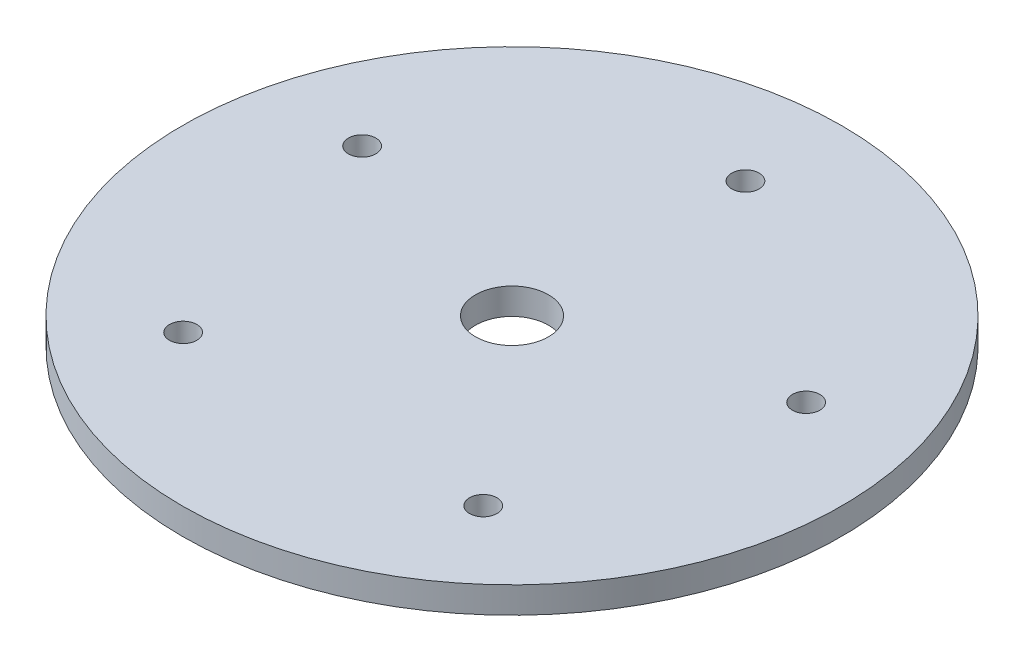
ISO-10303-21;
HEADER;
FILE_DESCRIPTION(('STEP AP214'),'2;1');
FILE_NAME('part.step','',(''),(''),'','','');
FILE_SCHEMA(('AUTOMOTIVE_DESIGN { 1 0 10303 214 1 1 1 1 }'));
ENDSEC;
DATA;
#1=APPLICATION_CONTEXT('core data for automotive mechanical design processes');
#2=APPLICATION_PROTOCOL_DEFINITION('international standard','automotive_design',2000,#1);
#3=PRODUCT_CONTEXT('',#1,'mechanical');
#4=PRODUCT('Part','Part','',(#3));
#5=PRODUCT_RELATED_PRODUCT_CATEGORY('part','',(#4));
#6=PRODUCT_DEFINITION_FORMATION('','',#4);
#7=PRODUCT_DEFINITION_CONTEXT('part definition',#1,'design');
#8=PRODUCT_DEFINITION('design','',#6,#7);
#9=PRODUCT_DEFINITION_SHAPE('','',#8);
#10=(LENGTH_UNIT() NAMED_UNIT(*) SI_UNIT(.MILLI.,.METRE.));
#11=(NAMED_UNIT(*) PLANE_ANGLE_UNIT() SI_UNIT($,.RADIAN.));
#12=(NAMED_UNIT(*) SI_UNIT($,.STERADIAN.) SOLID_ANGLE_UNIT());
#13=UNCERTAINTY_MEASURE_WITH_UNIT(LENGTH_MEASURE(1.E-05),#10,'distance_accuracy_value','');
#14=(GEOMETRIC_REPRESENTATION_CONTEXT(3) GLOBAL_UNCERTAINTY_ASSIGNED_CONTEXT((#13)) GLOBAL_UNIT_ASSIGNED_CONTEXT((#10,
#11,#12)) REPRESENTATION_CONTEXT('',''));
#15=CARTESIAN_POINT('',(0.,0.,0.));
#16=DIRECTION('',(0.,0.,1.));
#17=DIRECTION('',(1.,0.,0.));
#18=AXIS2_PLACEMENT_3D('',#15,#16,#17);
#19=CARTESIAN_POINT('',(0.,3.048,0.));
#20=DIRECTION('',(0.,1.,0.));
#21=DIRECTION('',(0.,0.,1.));
#22=AXIS2_PLACEMENT_3D('',#19,#20,#21);
#23=PLANE('',#22);
#24=CARTESIAN_POINT('',(0.,3.048,0.));
#25=DIRECTION('',(0.,1.,0.));
#26=DIRECTION('',(0.,0.,1.));
#27=AXIS2_PLACEMENT_3D('',#24,#25,#26);
#28=CIRCLE('',#27,4.2164);
#29=CARTESIAN_POINT('',(0.,3.048,4.2164));
#30=VERTEX_POINT('',#29);
#31=EDGE_CURVE('E71',#30,#30,#28,.T.);
#32=ORIENTED_EDGE('',*,*,#31,.F.);
#33=EDGE_LOOP('',(#32));
#34=FACE_BOUND('',#33,.T.);
#35=CARTESIAN_POINT('',(-17.3472306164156,3.048,20.6736244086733));
#36=DIRECTION('',(0.,1.,0.));
#37=DIRECTION('',(0.,0.,1.));
#38=AXIS2_PLACEMENT_3D('',#35,#36,#37);
#39=CIRCLE('',#38,1.5875);
#40=CARTESIAN_POINT('',(-17.3472306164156,3.048,19.0861244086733));
#41=VERTEX_POINT('',#40);
#42=EDGE_CURVE('E59',#41,#41,#39,.T.);
#43=ORIENTED_EDGE('',*,*,#42,.F.);
#44=EDGE_LOOP('',(#43));
#45=FACE_BOUND('',#44,.T.);
#46=CARTESIAN_POINT('',(25.6666377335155,3.048,-8.33959613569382));
#47=DIRECTION('',(0.,1.,0.));
#48=DIRECTION('',(0.,0.,1.));
#49=AXIS2_PLACEMENT_3D('',#46,#47,#48);
#50=CIRCLE('',#49,1.5875);
#51=CARTESIAN_POINT('',(25.6666377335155,3.048,-9.92709613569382));
#52=VERTEX_POINT('',#51);
#53=EDGE_CURVE('E47',#52,#52,#50,.T.);
#54=ORIENTED_EDGE('',*,*,#53,.F.);
#55=EDGE_LOOP('',(#54));
#56=FACE_BOUND('',#55,.T.);
#57=CARTESIAN_POINT('',(0.,3.048,0.));
#58=DIRECTION('',(0.,1.,0.));
#59=DIRECTION('',(0.,0.,1.));
#60=AXIS2_PLACEMENT_3D('',#57,#58,#59);
#61=CIRCLE('',#60,38.1);
#62=CARTESIAN_POINT('',(0.,3.048,-38.1));
#63=VERTEX_POINT('',#62);
#64=EDGE_CURVE('E10',#63,#63,#61,.T.);
#65=ORIENTED_EDGE('',*,*,#64,.T.);
#66=EDGE_LOOP('',(#65));
#67=FACE_BOUND('',#66,.T.);
#68=CARTESIAN_POINT('',(0.,3.048,-26.9875));
#69=DIRECTION('',(0.,1.,0.));
#70=DIRECTION('',(0.,0.,1.));
#71=AXIS2_PLACEMENT_3D('',#68,#69,#70);
#72=CIRCLE('',#71,1.5875);
#73=CARTESIAN_POINT('',(0.,3.048,-28.575));
#74=VERTEX_POINT('',#73);
#75=EDGE_CURVE('E42',#74,#74,#72,.T.);
#76=ORIENTED_EDGE('',*,*,#75,.F.);
#77=EDGE_LOOP('',(#76));
#78=FACE_BOUND('',#77,.T.);
#79=CARTESIAN_POINT('',(17.3472306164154,3.048,20.6736244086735));
#80=DIRECTION('',(0.,1.,0.));
#81=DIRECTION('',(0.,0.,1.));
#82=AXIS2_PLACEMENT_3D('',#79,#80,#81);
#83=CIRCLE('',#82,1.5875);
#84=CARTESIAN_POINT('',(17.3472306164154,3.048,19.0861244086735));
#85=VERTEX_POINT('',#84);
#86=EDGE_CURVE('E53',#85,#85,#83,.T.);
#87=ORIENTED_EDGE('',*,*,#86,.F.);
#88=EDGE_LOOP('',(#87));
#89=FACE_BOUND('',#88,.T.);
#90=CARTESIAN_POINT('',(-25.6666377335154,3.048,-8.33959613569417));
#91=DIRECTION('',(0.,1.,0.));
#92=DIRECTION('',(0.,0.,1.));
#93=AXIS2_PLACEMENT_3D('',#90,#91,#92);
#94=CIRCLE('',#93,1.5875);
#95=CARTESIAN_POINT('',(-25.6666377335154,3.048,-9.92709613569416));
#96=VERTEX_POINT('',#95);
#97=EDGE_CURVE('E65',#96,#96,#94,.T.);
#98=ORIENTED_EDGE('',*,*,#97,.F.);
#99=EDGE_LOOP('',(#98));
#100=FACE_BOUND('',#99,.T.);
#101=ADVANCED_FACE('F31',(#34,#45,#56,#67,#78,#89,#100),#23,.T.);
#102=CARTESIAN_POINT('',(0.,0.,0.));
#103=DIRECTION('',(0.,1.,0.));
#104=DIRECTION('',(0.,0.,1.));
#105=AXIS2_PLACEMENT_3D('',#102,#103,#104);
#106=PLANE('',#105);
#107=CARTESIAN_POINT('',(0.,0.,0.));
#108=DIRECTION('',(0.,1.,0.));
#109=DIRECTION('',(0.,0.,1.));
#110=AXIS2_PLACEMENT_3D('',#107,#108,#109);
#111=CIRCLE('',#110,4.2164);
#112=CARTESIAN_POINT('',(0.,0.,4.2164));
#113=VERTEX_POINT('',#112);
#114=EDGE_CURVE('E76',#113,#113,#111,.T.);
#115=ORIENTED_EDGE('',*,*,#114,.T.);
#116=EDGE_LOOP('',(#115));
#117=FACE_BOUND('',#116,.T.);
#118=CARTESIAN_POINT('',(0.,0.,0.));
#119=DIRECTION('',(0.,1.,0.));
#120=DIRECTION('',(0.,0.,1.));
#121=AXIS2_PLACEMENT_3D('',#118,#119,#120);
#122=CIRCLE('',#121,38.1);
#123=CARTESIAN_POINT('',(0.,0.,-38.1));
#124=VERTEX_POINT('',#123);
#125=EDGE_CURVE('E35',#124,#124,#122,.T.);
#126=ORIENTED_EDGE('',*,*,#125,.F.);
#127=EDGE_LOOP('',(#126));
#128=FACE_BOUND('',#127,.T.);
#129=CARTESIAN_POINT('',(0.,0.,-26.9875));
#130=DIRECTION('',(0.,1.,0.));
#131=DIRECTION('',(0.,0.,1.));
#132=AXIS2_PLACEMENT_3D('',#129,#130,#131);
#133=CIRCLE('',#132,1.5875);
#134=CARTESIAN_POINT('',(0.,0.,-28.575));
#135=VERTEX_POINT('',#134);
#136=EDGE_CURVE('E44',#135,#135,#133,.T.);
#137=ORIENTED_EDGE('',*,*,#136,.T.);
#138=EDGE_LOOP('',(#137));
#139=FACE_BOUND('',#138,.T.);
#140=CARTESIAN_POINT('',(25.6666377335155,0.,-8.33959613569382));
#141=DIRECTION('',(0.,1.,0.));
#142=DIRECTION('',(0.,0.,1.));
#143=AXIS2_PLACEMENT_3D('',#140,#141,#142);
#144=CIRCLE('',#143,1.5875);
#145=CARTESIAN_POINT('',(25.6666377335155,0.,-9.92709613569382));
#146=VERTEX_POINT('',#145);
#147=EDGE_CURVE('E50',#146,#146,#144,.T.);
#148=ORIENTED_EDGE('',*,*,#147,.T.);
#149=EDGE_LOOP('',(#148));
#150=FACE_BOUND('',#149,.T.);
#151=CARTESIAN_POINT('',(17.3472306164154,0.,20.6736244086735));
#152=DIRECTION('',(0.,1.,0.));
#153=DIRECTION('',(0.,0.,1.));
#154=AXIS2_PLACEMENT_3D('',#151,#152,#153);
#155=CIRCLE('',#154,1.5875);
#156=CARTESIAN_POINT('',(17.3472306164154,0.,19.0861244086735));
#157=VERTEX_POINT('',#156);
#158=EDGE_CURVE('E56',#157,#157,#155,.T.);
#159=ORIENTED_EDGE('',*,*,#158,.T.);
#160=EDGE_LOOP('',(#159));
#161=FACE_BOUND('',#160,.T.);
#162=CARTESIAN_POINT('',(-17.3472306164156,0.,20.6736244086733));
#163=DIRECTION('',(0.,1.,0.));
#164=DIRECTION('',(0.,0.,1.));
#165=AXIS2_PLACEMENT_3D('',#162,#163,#164);
#166=CIRCLE('',#165,1.5875);
#167=CARTESIAN_POINT('',(-17.3472306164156,0.,19.0861244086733));
#168=VERTEX_POINT('',#167);
#169=EDGE_CURVE('E62',#168,#168,#166,.T.);
#170=ORIENTED_EDGE('',*,*,#169,.T.);
#171=EDGE_LOOP('',(#170));
#172=FACE_BOUND('',#171,.T.);
#173=CARTESIAN_POINT('',(-25.6666377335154,0.,-8.33959613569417));
#174=DIRECTION('',(0.,1.,0.));
#175=DIRECTION('',(0.,0.,1.));
#176=AXIS2_PLACEMENT_3D('',#173,#174,#175);
#177=CIRCLE('',#176,1.5875);
#178=CARTESIAN_POINT('',(-25.6666377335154,0.,-9.92709613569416));
#179=VERTEX_POINT('',#178);
#180=EDGE_CURVE('E68',#179,#179,#177,.T.);
#181=ORIENTED_EDGE('',*,*,#180,.T.);
#182=EDGE_LOOP('',(#181));
#183=FACE_BOUND('',#182,.T.);
#184=ADVANCED_FACE('F80',(#117,#128,#139,#150,#161,#172,#183),#106,.F.);
#185=CARTESIAN_POINT('',(0.,3.048,0.));
#186=DIRECTION('',(0.,-1.,0.));
#187=DIRECTION('',(0.,0.,-1.));
#188=AXIS2_PLACEMENT_3D('',#185,#186,#187);
#189=CYLINDRICAL_SURFACE('',#188,38.1);
#190=CARTESIAN_POINT('',(0.,3.048,-38.1));
#191=CARTESIAN_POINT('',(0.,3.01625,-38.1));
#192=CARTESIAN_POINT('',(0.,2.9845,-38.1));
#193=CARTESIAN_POINT('',(0.,2.921,-38.1));
#194=CARTESIAN_POINT('',(0.,2.88925,-38.1));
#195=CARTESIAN_POINT('',(0.,2.82575,-38.1));
#196=CARTESIAN_POINT('',(0.,2.794,-38.1));
#197=CARTESIAN_POINT('',(0.,2.7305,-38.1));
#198=CARTESIAN_POINT('',(0.,2.69875,-38.1));
#199=CARTESIAN_POINT('',(0.,2.63525,-38.1));
#200=CARTESIAN_POINT('',(0.,2.6035,-38.1));
#201=CARTESIAN_POINT('',(0.,2.54,-38.1));
#202=CARTESIAN_POINT('',(0.,2.50825,-38.1));
#203=CARTESIAN_POINT('',(0.,2.44475,-38.1));
#204=CARTESIAN_POINT('',(0.,2.413,-38.1));
#205=CARTESIAN_POINT('',(0.,2.3495,-38.1));
#206=CARTESIAN_POINT('',(0.,2.31775,-38.1));
#207=CARTESIAN_POINT('',(0.,2.25425,-38.1));
#208=CARTESIAN_POINT('',(0.,2.2225,-38.1));
#209=CARTESIAN_POINT('',(0.,2.159,-38.1));
#210=CARTESIAN_POINT('',(0.,2.12725,-38.1));
#211=CARTESIAN_POINT('',(0.,2.06375,-38.1));
#212=CARTESIAN_POINT('',(0.,2.032,-38.1));
#213=CARTESIAN_POINT('',(0.,1.9685,-38.1));
#214=CARTESIAN_POINT('',(0.,1.93675,-38.1));
#215=CARTESIAN_POINT('',(0.,1.87325,-38.1));
#216=CARTESIAN_POINT('',(0.,1.8415,-38.1));
#217=CARTESIAN_POINT('',(0.,1.778,-38.1));
#218=CARTESIAN_POINT('',(0.,1.74625,-38.1));
#219=CARTESIAN_POINT('',(0.,1.68275,-38.1));
#220=CARTESIAN_POINT('',(0.,1.651,-38.1));
#221=CARTESIAN_POINT('',(0.,1.5875,-38.1));
#222=CARTESIAN_POINT('',(0.,1.55575,-38.1));
#223=CARTESIAN_POINT('',(0.,1.49225,-38.1));
#224=CARTESIAN_POINT('',(0.,1.4605,-38.1));
#225=CARTESIAN_POINT('',(0.,1.397,-38.1));
#226=CARTESIAN_POINT('',(0.,1.36525,-38.1));
#227=CARTESIAN_POINT('',(0.,1.30175,-38.1));
#228=CARTESIAN_POINT('',(0.,1.27,-38.1));
#229=CARTESIAN_POINT('',(0.,1.2065,-38.1));
#230=CARTESIAN_POINT('',(0.,1.17475,-38.1));
#231=CARTESIAN_POINT('',(0.,1.11125,-38.1));
#232=CARTESIAN_POINT('',(0.,1.0795,-38.1));
#233=CARTESIAN_POINT('',(0.,1.016,-38.1));
#234=CARTESIAN_POINT('',(0.,0.98425,-38.1));
#235=CARTESIAN_POINT('',(0.,0.92075,-38.1));
#236=CARTESIAN_POINT('',(0.,0.889,-38.1));
#237=CARTESIAN_POINT('',(0.,0.8255,-38.1));
#238=CARTESIAN_POINT('',(0.,0.79375,-38.1));
#239=CARTESIAN_POINT('',(0.,0.73025,-38.1));
#240=CARTESIAN_POINT('',(0.,0.6985,-38.1));
#241=CARTESIAN_POINT('',(0.,0.635,-38.1));
#242=CARTESIAN_POINT('',(0.,0.60325,-38.1));
#243=CARTESIAN_POINT('',(0.,0.53975,-38.1));
#244=CARTESIAN_POINT('',(0.,0.508,-38.1));
#245=CARTESIAN_POINT('',(0.,0.4445,-38.1));
#246=CARTESIAN_POINT('',(0.,0.41275,-38.1));
#247=CARTESIAN_POINT('',(0.,0.34925,-38.1));
#248=CARTESIAN_POINT('',(0.,0.3175,-38.1));
#249=CARTESIAN_POINT('',(0.,0.254,-38.1));
#250=CARTESIAN_POINT('',(0.,0.22225,-38.1));
#251=CARTESIAN_POINT('',(0.,0.15875,-38.1));
#252=CARTESIAN_POINT('',(0.,0.127,-38.1));
#253=CARTESIAN_POINT('',(0.,0.0634999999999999,-38.1));
#254=CARTESIAN_POINT('',(0.,0.03175,-38.1));
#255=CARTESIAN_POINT('',(0.,0.,-38.1));
#256=B_SPLINE_CURVE_WITH_KNOTS('',3,(#190,#191,#192,#193,#194,#195,#196,#197,#198,#199,#200,
#201,#202,#203,#204,#205,#206,#207,#208,#209,#210,#211,#212,#213,#214,#215,#216,#217,#218,#219,
#220,#221,#222,#223,#224,#225,#226,#227,#228,#229,#230,#231,#232,#233,#234,#235,#236,#237,#238,
#239,#240,#241,#242,#243,#244,#245,#246,#247,#248,#249,#250,#251,#252,#253,#254,#255),
.UNSPECIFIED.,.F.,.F.,(4,2,2,2,2,2,2,2,2,2,2,2,2,2,2,2,2,2,2,2,2,2,2,2,2,2,2,2,2,2,2,2,4),(0.,
0.0952499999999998,0.1905,0.28575,0.381,0.47625,0.5715,0.66675,0.762,0.85725,0.9525,1.04775,
1.143,1.23825,1.3335,1.42875,1.524,1.61925,1.7145,1.80975,1.905,2.00025,2.0955,2.19075,2.286,
2.38125,2.4765,2.57175,2.667,2.76225,2.8575,2.95275,3.048),.UNSPECIFIED.);
#257=EDGE_CURVE('BSEAM33',#63,#124,#256,.T.);
#258=ORIENTED_EDGE('',*,*,#64,.F.);
#259=ORIENTED_EDGE('',*,*,#125,.T.);
#260=ORIENTED_EDGE('',*,*,#257,.T.);
#261=ORIENTED_EDGE('',*,*,#257,.F.);
#262=EDGE_LOOP('',(#258,#260,#259,#261));
#263=FACE_BOUND('',#262,.T.);
#264=ADVANCED_FACE('F33',(#263),#189,.T.);
#265=CARTESIAN_POINT('',(0.,3.048,-26.9875));
#266=DIRECTION('',(0.,-1.,0.));
#267=DIRECTION('',(0.,0.,-1.));
#268=AXIS2_PLACEMENT_3D('',#265,#266,#267);
#269=CYLINDRICAL_SURFACE('',#268,1.5875);
#270=CARTESIAN_POINT('',(0.,3.048,-28.575));
#271=CARTESIAN_POINT('',(0.,3.01625,-28.575));
#272=CARTESIAN_POINT('',(0.,2.9845,-28.575));
#273=CARTESIAN_POINT('',(0.,2.921,-28.575));
#274=CARTESIAN_POINT('',(0.,2.88925,-28.575));
#275=CARTESIAN_POINT('',(0.,2.82575,-28.575));
#276=CARTESIAN_POINT('',(0.,2.794,-28.575));
#277=CARTESIAN_POINT('',(0.,2.7305,-28.575));
#278=CARTESIAN_POINT('',(0.,2.69875,-28.575));
#279=CARTESIAN_POINT('',(0.,2.63525,-28.575));
#280=CARTESIAN_POINT('',(0.,2.6035,-28.575));
#281=CARTESIAN_POINT('',(0.,2.54,-28.575));
#282=CARTESIAN_POINT('',(0.,2.50825,-28.575));
#283=CARTESIAN_POINT('',(0.,2.44475,-28.575));
#284=CARTESIAN_POINT('',(0.,2.413,-28.575));
#285=CARTESIAN_POINT('',(0.,2.3495,-28.575));
#286=CARTESIAN_POINT('',(0.,2.31775,-28.575));
#287=CARTESIAN_POINT('',(0.,2.25425,-28.575));
#288=CARTESIAN_POINT('',(0.,2.2225,-28.575));
#289=CARTESIAN_POINT('',(0.,2.159,-28.575));
#290=CARTESIAN_POINT('',(0.,2.12725,-28.575));
#291=CARTESIAN_POINT('',(0.,2.06375,-28.575));
#292=CARTESIAN_POINT('',(0.,2.032,-28.575));
#293=CARTESIAN_POINT('',(0.,1.9685,-28.575));
#294=CARTESIAN_POINT('',(0.,1.93675,-28.575));
#295=CARTESIAN_POINT('',(0.,1.87325,-28.575));
#296=CARTESIAN_POINT('',(0.,1.8415,-28.575));
#297=CARTESIAN_POINT('',(0.,1.778,-28.575));
#298=CARTESIAN_POINT('',(0.,1.74625,-28.575));
#299=CARTESIAN_POINT('',(0.,1.68275,-28.575));
#300=CARTESIAN_POINT('',(0.,1.651,-28.575));
#301=CARTESIAN_POINT('',(0.,1.5875,-28.575));
#302=CARTESIAN_POINT('',(0.,1.55575,-28.575));
#303=CARTESIAN_POINT('',(0.,1.49225,-28.575));
#304=CARTESIAN_POINT('',(0.,1.4605,-28.575));
#305=CARTESIAN_POINT('',(0.,1.397,-28.575));
#306=CARTESIAN_POINT('',(0.,1.36525,-28.575));
#307=CARTESIAN_POINT('',(0.,1.30175,-28.575));
#308=CARTESIAN_POINT('',(0.,1.27,-28.575));
#309=CARTESIAN_POINT('',(0.,1.2065,-28.575));
#310=CARTESIAN_POINT('',(0.,1.17475,-28.575));
#311=CARTESIAN_POINT('',(0.,1.11125,-28.575));
#312=CARTESIAN_POINT('',(0.,1.0795,-28.575));
#313=CARTESIAN_POINT('',(0.,1.016,-28.575));
#314=CARTESIAN_POINT('',(0.,0.98425,-28.575));
#315=CARTESIAN_POINT('',(0.,0.92075,-28.575));
#316=CARTESIAN_POINT('',(0.,0.889,-28.575));
#317=CARTESIAN_POINT('',(0.,0.8255,-28.575));
#318=CARTESIAN_POINT('',(0.,0.79375,-28.575));
#319=CARTESIAN_POINT('',(0.,0.73025,-28.575));
#320=CARTESIAN_POINT('',(0.,0.6985,-28.575));
#321=CARTESIAN_POINT('',(0.,0.635,-28.575));
#322=CARTESIAN_POINT('',(0.,0.60325,-28.575));
#323=CARTESIAN_POINT('',(0.,0.53975,-28.575));
#324=CARTESIAN_POINT('',(0.,0.508,-28.575));
#325=CARTESIAN_POINT('',(0.,0.4445,-28.575));
#326=CARTESIAN_POINT('',(0.,0.41275,-28.575));
#327=CARTESIAN_POINT('',(0.,0.34925,-28.575));
#328=CARTESIAN_POINT('',(0.,0.3175,-28.575));
#329=CARTESIAN_POINT('',(0.,0.254,-28.575));
#330=CARTESIAN_POINT('',(0.,0.22225,-28.575));
#331=CARTESIAN_POINT('',(0.,0.15875,-28.575));
#332=CARTESIAN_POINT('',(0.,0.127,-28.575));
#333=CARTESIAN_POINT('',(0.,0.0634999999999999,-28.575));
#334=CARTESIAN_POINT('',(0.,0.03175,-28.575));
#335=CARTESIAN_POINT('',(0.,0.,-28.575));
#336=B_SPLINE_CURVE_WITH_KNOTS('',3,(#270,#271,#272,#273,#274,#275,#276,#277,#278,#279,#280,
#281,#282,#283,#284,#285,#286,#287,#288,#289,#290,#291,#292,#293,#294,#295,#296,#297,#298,#299,
#300,#301,#302,#303,#304,#305,#306,#307,#308,#309,#310,#311,#312,#313,#314,#315,#316,#317,#318,
#319,#320,#321,#322,#323,#324,#325,#326,#327,#328,#329,#330,#331,#332,#333,#334,#335),
.UNSPECIFIED.,.F.,.F.,(4,2,2,2,2,2,2,2,2,2,2,2,2,2,2,2,2,2,2,2,2,2,2,2,2,2,2,2,2,2,2,2,4),(0.,
0.0952499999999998,0.1905,0.28575,0.381,0.47625,0.5715,0.66675,0.762,0.85725,0.9525,1.04775,
1.143,1.23825,1.3335,1.42875,1.524,1.61925,1.7145,1.80975,1.905,2.00025,2.0955,2.19075,2.286,
2.38125,2.4765,2.57175,2.667,2.76225,2.8575,2.95275,3.048),.UNSPECIFIED.);
#337=EDGE_CURVE('BSEAM104',#74,#135,#336,.T.);
#338=ORIENTED_EDGE('',*,*,#75,.T.);
#339=ORIENTED_EDGE('',*,*,#136,.F.);
#340=ORIENTED_EDGE('',*,*,#337,.T.);
#341=ORIENTED_EDGE('',*,*,#337,.F.);
#342=EDGE_LOOP('',(#338,#340,#339,#341));
#343=FACE_BOUND('',#342,.T.);
#344=ADVANCED_FACE('F104',(#343),#269,.F.);
#345=CARTESIAN_POINT('',(25.6666377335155,3.048,-8.33959613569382));
#346=DIRECTION('',(0.,-1.,0.));
#347=DIRECTION('',(0.,0.,-1.));
#348=AXIS2_PLACEMENT_3D('',#345,#346,#347);
#349=CYLINDRICAL_SURFACE('',#348,1.5875);
#350=CARTESIAN_POINT('',(25.6666377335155,3.048,-9.92709613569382));
#351=CARTESIAN_POINT('',(25.6666377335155,3.01625,-9.92709613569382));
#352=CARTESIAN_POINT('',(25.6666377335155,2.9845,-9.92709613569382));
#353=CARTESIAN_POINT('',(25.6666377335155,2.921,-9.92709613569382));
#354=CARTESIAN_POINT('',(25.6666377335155,2.88925,-9.92709613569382));
#355=CARTESIAN_POINT('',(25.6666377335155,2.82575,-9.92709613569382));
#356=CARTESIAN_POINT('',(25.6666377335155,2.794,-9.92709613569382));
#357=CARTESIAN_POINT('',(25.6666377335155,2.7305,-9.92709613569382));
#358=CARTESIAN_POINT('',(25.6666377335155,2.69875,-9.92709613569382));
#359=CARTESIAN_POINT('',(25.6666377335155,2.63525,-9.92709613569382));
#360=CARTESIAN_POINT('',(25.6666377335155,2.6035,-9.92709613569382));
#361=CARTESIAN_POINT('',(25.6666377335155,2.54,-9.92709613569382));
#362=CARTESIAN_POINT('',(25.6666377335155,2.50825,-9.92709613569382));
#363=CARTESIAN_POINT('',(25.6666377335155,2.44475,-9.92709613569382));
#364=CARTESIAN_POINT('',(25.6666377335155,2.413,-9.92709613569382));
#365=CARTESIAN_POINT('',(25.6666377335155,2.3495,-9.92709613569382));
#366=CARTESIAN_POINT('',(25.6666377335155,2.31775,-9.92709613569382));
#367=CARTESIAN_POINT('',(25.6666377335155,2.25425,-9.92709613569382));
#368=CARTESIAN_POINT('',(25.6666377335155,2.2225,-9.92709613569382));
#369=CARTESIAN_POINT('',(25.6666377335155,2.159,-9.92709613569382));
#370=CARTESIAN_POINT('',(25.6666377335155,2.12725,-9.92709613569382));
#371=CARTESIAN_POINT('',(25.6666377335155,2.06375,-9.92709613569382));
#372=CARTESIAN_POINT('',(25.6666377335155,2.032,-9.92709613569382));
#373=CARTESIAN_POINT('',(25.6666377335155,1.9685,-9.92709613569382));
#374=CARTESIAN_POINT('',(25.6666377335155,1.93675,-9.92709613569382));
#375=CARTESIAN_POINT('',(25.6666377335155,1.87325,-9.92709613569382));
#376=CARTESIAN_POINT('',(25.6666377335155,1.8415,-9.92709613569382));
#377=CARTESIAN_POINT('',(25.6666377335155,1.778,-9.92709613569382));
#378=CARTESIAN_POINT('',(25.6666377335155,1.74625,-9.92709613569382));
#379=CARTESIAN_POINT('',(25.6666377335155,1.68275,-9.92709613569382));
#380=CARTESIAN_POINT('',(25.6666377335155,1.651,-9.92709613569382));
#381=CARTESIAN_POINT('',(25.6666377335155,1.5875,-9.92709613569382));
#382=CARTESIAN_POINT('',(25.6666377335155,1.55575,-9.92709613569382));
#383=CARTESIAN_POINT('',(25.6666377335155,1.49225,-9.92709613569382));
#384=CARTESIAN_POINT('',(25.6666377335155,1.4605,-9.92709613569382));
#385=CARTESIAN_POINT('',(25.6666377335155,1.397,-9.92709613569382));
#386=CARTESIAN_POINT('',(25.6666377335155,1.36525,-9.92709613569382));
#387=CARTESIAN_POINT('',(25.6666377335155,1.30175,-9.92709613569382));
#388=CARTESIAN_POINT('',(25.6666377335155,1.27,-9.92709613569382));
#389=CARTESIAN_POINT('',(25.6666377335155,1.2065,-9.92709613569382));
#390=CARTESIAN_POINT('',(25.6666377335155,1.17475,-9.92709613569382));
#391=CARTESIAN_POINT('',(25.6666377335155,1.11125,-9.92709613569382));
#392=CARTESIAN_POINT('',(25.6666377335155,1.0795,-9.92709613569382));
#393=CARTESIAN_POINT('',(25.6666377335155,1.016,-9.92709613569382));
#394=CARTESIAN_POINT('',(25.6666377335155,0.98425,-9.92709613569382));
#395=CARTESIAN_POINT('',(25.6666377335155,0.92075,-9.92709613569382));
#396=CARTESIAN_POINT('',(25.6666377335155,0.889,-9.92709613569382));
#397=CARTESIAN_POINT('',(25.6666377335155,0.8255,-9.92709613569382));
#398=CARTESIAN_POINT('',(25.6666377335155,0.79375,-9.92709613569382));
#399=CARTESIAN_POINT('',(25.6666377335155,0.73025,-9.92709613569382));
#400=CARTESIAN_POINT('',(25.6666377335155,0.6985,-9.92709613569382));
#401=CARTESIAN_POINT('',(25.6666377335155,0.635,-9.92709613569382));
#402=CARTESIAN_POINT('',(25.6666377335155,0.60325,-9.92709613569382));
#403=CARTESIAN_POINT('',(25.6666377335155,0.53975,-9.92709613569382));
#404=CARTESIAN_POINT('',(25.6666377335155,0.508,-9.92709613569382));
#405=CARTESIAN_POINT('',(25.6666377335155,0.4445,-9.92709613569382));
#406=CARTESIAN_POINT('',(25.6666377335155,0.41275,-9.92709613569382));
#407=CARTESIAN_POINT('',(25.6666377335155,0.34925,-9.92709613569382));
#408=CARTESIAN_POINT('',(25.6666377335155,0.3175,-9.92709613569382));
#409=CARTESIAN_POINT('',(25.6666377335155,0.254,-9.92709613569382));
#410=CARTESIAN_POINT('',(25.6666377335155,0.22225,-9.92709613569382));
#411=CARTESIAN_POINT('',(25.6666377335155,0.15875,-9.92709613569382));
#412=CARTESIAN_POINT('',(25.6666377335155,0.127,-9.92709613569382));
#413=CARTESIAN_POINT('',(25.6666377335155,0.0634999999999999,-9.92709613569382));
#414=CARTESIAN_POINT('',(25.6666377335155,0.03175,-9.92709613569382));
#415=CARTESIAN_POINT('',(25.6666377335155,0.,-9.92709613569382));
#416=B_SPLINE_CURVE_WITH_KNOTS('',3,(#350,#351,#352,#353,#354,#355,#356,#357,#358,#359,#360,
#361,#362,#363,#364,#365,#366,#367,#368,#369,#370,#371,#372,#373,#374,#375,#376,#377,#378,#379,
#380,#381,#382,#383,#384,#385,#386,#387,#388,#389,#390,#391,#392,#393,#394,#395,#396,#397,#398,
#399,#400,#401,#402,#403,#404,#405,#406,#407,#408,#409,#410,#411,#412,#413,#414,#415),
.UNSPECIFIED.,.F.,.F.,(4,2,2,2,2,2,2,2,2,2,2,2,2,2,2,2,2,2,2,2,2,2,2,2,2,2,2,2,2,2,2,2,4),(0.,
0.0952499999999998,0.1905,0.28575,0.381,0.47625,0.5715,0.66675,0.762,0.85725,0.9525,1.04775,
1.143,1.23825,1.3335,1.42875,1.524,1.61925,1.7145,1.80975,1.905,2.00025,2.0955,2.19075,2.286,
2.38125,2.4765,2.57175,2.667,2.76225,2.8575,2.95275,3.048),.UNSPECIFIED.);
#417=EDGE_CURVE('BSEAM107',#52,#146,#416,.T.);
#418=ORIENTED_EDGE('',*,*,#53,.T.);
#419=ORIENTED_EDGE('',*,*,#147,.F.);
#420=ORIENTED_EDGE('',*,*,#417,.T.);
#421=ORIENTED_EDGE('',*,*,#417,.F.);
#422=EDGE_LOOP('',(#418,#420,#419,#421));
#423=FACE_BOUND('',#422,.T.);
#424=ADVANCED_FACE('F107',(#423),#349,.F.);
#425=CARTESIAN_POINT('',(17.3472306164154,3.048,20.6736244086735));
#426=DIRECTION('',(0.,-1.,0.));
#427=DIRECTION('',(0.,0.,-1.));
#428=AXIS2_PLACEMENT_3D('',#425,#426,#427);
#429=CYLINDRICAL_SURFACE('',#428,1.5875);
#430=CARTESIAN_POINT('',(17.3472306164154,3.048,19.0861244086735));
#431=CARTESIAN_POINT('',(17.3472306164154,3.01625,19.0861244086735));
#432=CARTESIAN_POINT('',(17.3472306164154,2.9845,19.0861244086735));
#433=CARTESIAN_POINT('',(17.3472306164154,2.921,19.0861244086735));
#434=CARTESIAN_POINT('',(17.3472306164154,2.88925,19.0861244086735));
#435=CARTESIAN_POINT('',(17.3472306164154,2.82575,19.0861244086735));
#436=CARTESIAN_POINT('',(17.3472306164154,2.794,19.0861244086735));
#437=CARTESIAN_POINT('',(17.3472306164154,2.7305,19.0861244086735));
#438=CARTESIAN_POINT('',(17.3472306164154,2.69875,19.0861244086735));
#439=CARTESIAN_POINT('',(17.3472306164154,2.63525,19.0861244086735));
#440=CARTESIAN_POINT('',(17.3472306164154,2.6035,19.0861244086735));
#441=CARTESIAN_POINT('',(17.3472306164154,2.54,19.0861244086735));
#442=CARTESIAN_POINT('',(17.3472306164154,2.50825,19.0861244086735));
#443=CARTESIAN_POINT('',(17.3472306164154,2.44475,19.0861244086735));
#444=CARTESIAN_POINT('',(17.3472306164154,2.413,19.0861244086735));
#445=CARTESIAN_POINT('',(17.3472306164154,2.3495,19.0861244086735));
#446=CARTESIAN_POINT('',(17.3472306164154,2.31775,19.0861244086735));
#447=CARTESIAN_POINT('',(17.3472306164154,2.25425,19.0861244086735));
#448=CARTESIAN_POINT('',(17.3472306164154,2.2225,19.0861244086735));
#449=CARTESIAN_POINT('',(17.3472306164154,2.159,19.0861244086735));
#450=CARTESIAN_POINT('',(17.3472306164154,2.12725,19.0861244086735));
#451=CARTESIAN_POINT('',(17.3472306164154,2.06375,19.0861244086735));
#452=CARTESIAN_POINT('',(17.3472306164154,2.032,19.0861244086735));
#453=CARTESIAN_POINT('',(17.3472306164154,1.9685,19.0861244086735));
#454=CARTESIAN_POINT('',(17.3472306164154,1.93675,19.0861244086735));
#455=CARTESIAN_POINT('',(17.3472306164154,1.87325,19.0861244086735));
#456=CARTESIAN_POINT('',(17.3472306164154,1.8415,19.0861244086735));
#457=CARTESIAN_POINT('',(17.3472306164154,1.778,19.0861244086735));
#458=CARTESIAN_POINT('',(17.3472306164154,1.74625,19.0861244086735));
#459=CARTESIAN_POINT('',(17.3472306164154,1.68275,19.0861244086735));
#460=CARTESIAN_POINT('',(17.3472306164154,1.651,19.0861244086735));
#461=CARTESIAN_POINT('',(17.3472306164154,1.5875,19.0861244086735));
#462=CARTESIAN_POINT('',(17.3472306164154,1.55575,19.0861244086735));
#463=CARTESIAN_POINT('',(17.3472306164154,1.49225,19.0861244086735));
#464=CARTESIAN_POINT('',(17.3472306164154,1.4605,19.0861244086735));
#465=CARTESIAN_POINT('',(17.3472306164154,1.397,19.0861244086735));
#466=CARTESIAN_POINT('',(17.3472306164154,1.36525,19.0861244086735));
#467=CARTESIAN_POINT('',(17.3472306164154,1.30175,19.0861244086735));
#468=CARTESIAN_POINT('',(17.3472306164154,1.27,19.0861244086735));
#469=CARTESIAN_POINT('',(17.3472306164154,1.2065,19.0861244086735));
#470=CARTESIAN_POINT('',(17.3472306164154,1.17475,19.0861244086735));
#471=CARTESIAN_POINT('',(17.3472306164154,1.11125,19.0861244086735));
#472=CARTESIAN_POINT('',(17.3472306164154,1.0795,19.0861244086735));
#473=CARTESIAN_POINT('',(17.3472306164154,1.016,19.0861244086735));
#474=CARTESIAN_POINT('',(17.3472306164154,0.98425,19.0861244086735));
#475=CARTESIAN_POINT('',(17.3472306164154,0.92075,19.0861244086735));
#476=CARTESIAN_POINT('',(17.3472306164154,0.889,19.0861244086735));
#477=CARTESIAN_POINT('',(17.3472306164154,0.8255,19.0861244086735));
#478=CARTESIAN_POINT('',(17.3472306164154,0.79375,19.0861244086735));
#479=CARTESIAN_POINT('',(17.3472306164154,0.73025,19.0861244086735));
#480=CARTESIAN_POINT('',(17.3472306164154,0.6985,19.0861244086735));
#481=CARTESIAN_POINT('',(17.3472306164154,0.635,19.0861244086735));
#482=CARTESIAN_POINT('',(17.3472306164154,0.60325,19.0861244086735));
#483=CARTESIAN_POINT('',(17.3472306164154,0.53975,19.0861244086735));
#484=CARTESIAN_POINT('',(17.3472306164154,0.508,19.0861244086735));
#485=CARTESIAN_POINT('',(17.3472306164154,0.4445,19.0861244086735));
#486=CARTESIAN_POINT('',(17.3472306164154,0.41275,19.0861244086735));
#487=CARTESIAN_POINT('',(17.3472306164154,0.34925,19.0861244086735));
#488=CARTESIAN_POINT('',(17.3472306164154,0.3175,19.0861244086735));
#489=CARTESIAN_POINT('',(17.3472306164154,0.254,19.0861244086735));
#490=CARTESIAN_POINT('',(17.3472306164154,0.22225,19.0861244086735));
#491=CARTESIAN_POINT('',(17.3472306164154,0.15875,19.0861244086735));
#492=CARTESIAN_POINT('',(17.3472306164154,0.127,19.0861244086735));
#493=CARTESIAN_POINT('',(17.3472306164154,0.0634999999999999,19.0861244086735));
#494=CARTESIAN_POINT('',(17.3472306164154,0.03175,19.0861244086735));
#495=CARTESIAN_POINT('',(17.3472306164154,0.,19.0861244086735));
#496=B_SPLINE_CURVE_WITH_KNOTS('',3,(#430,#431,#432,#433,#434,#435,#436,#437,#438,#439,#440,
#441,#442,#443,#444,#445,#446,#447,#448,#449,#450,#451,#452,#453,#454,#455,#456,#457,#458,#459,
#460,#461,#462,#463,#464,#465,#466,#467,#468,#469,#470,#471,#472,#473,#474,#475,#476,#477,#478,
#479,#480,#481,#482,#483,#484,#485,#486,#487,#488,#489,#490,#491,#492,#493,#494,#495),
.UNSPECIFIED.,.F.,.F.,(4,2,2,2,2,2,2,2,2,2,2,2,2,2,2,2,2,2,2,2,2,2,2,2,2,2,2,2,2,2,2,2,4),(0.,
0.0952499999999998,0.1905,0.28575,0.381,0.47625,0.5715,0.66675,0.762,0.85725,0.9525,1.04775,
1.143,1.23825,1.3335,1.42875,1.524,1.61925,1.7145,1.80975,1.905,2.00025,2.0955,2.19075,2.286,
2.38125,2.4765,2.57175,2.667,2.76225,2.8575,2.95275,3.048),.UNSPECIFIED.);
#497=EDGE_CURVE('BSEAM111',#85,#157,#496,.T.);
#498=ORIENTED_EDGE('',*,*,#86,.T.);
#499=ORIENTED_EDGE('',*,*,#158,.F.);
#500=ORIENTED_EDGE('',*,*,#497,.T.);
#501=ORIENTED_EDGE('',*,*,#497,.F.);
#502=EDGE_LOOP('',(#498,#500,#499,#501));
#503=FACE_BOUND('',#502,.T.);
#504=ADVANCED_FACE('F111',(#503),#429,.F.);
#505=CARTESIAN_POINT('',(-17.3472306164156,3.048,20.6736244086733));
#506=DIRECTION('',(0.,-1.,0.));
#507=DIRECTION('',(0.,0.,-1.));
#508=AXIS2_PLACEMENT_3D('',#505,#506,#507);
#509=CYLINDRICAL_SURFACE('',#508,1.5875);
#510=CARTESIAN_POINT('',(-17.3472306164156,3.048,19.0861244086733));
#511=CARTESIAN_POINT('',(-17.3472306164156,3.01625,19.0861244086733));
#512=CARTESIAN_POINT('',(-17.3472306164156,2.9845,19.0861244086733));
#513=CARTESIAN_POINT('',(-17.3472306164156,2.921,19.0861244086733));
#514=CARTESIAN_POINT('',(-17.3472306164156,2.88925,19.0861244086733));
#515=CARTESIAN_POINT('',(-17.3472306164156,2.82575,19.0861244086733));
#516=CARTESIAN_POINT('',(-17.3472306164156,2.794,19.0861244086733));
#517=CARTESIAN_POINT('',(-17.3472306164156,2.7305,19.0861244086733));
#518=CARTESIAN_POINT('',(-17.3472306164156,2.69875,19.0861244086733));
#519=CARTESIAN_POINT('',(-17.3472306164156,2.63525,19.0861244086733));
#520=CARTESIAN_POINT('',(-17.3472306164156,2.6035,19.0861244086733));
#521=CARTESIAN_POINT('',(-17.3472306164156,2.54,19.0861244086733));
#522=CARTESIAN_POINT('',(-17.3472306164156,2.50825,19.0861244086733));
#523=CARTESIAN_POINT('',(-17.3472306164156,2.44475,19.0861244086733));
#524=CARTESIAN_POINT('',(-17.3472306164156,2.413,19.0861244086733));
#525=CARTESIAN_POINT('',(-17.3472306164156,2.3495,19.0861244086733));
#526=CARTESIAN_POINT('',(-17.3472306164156,2.31775,19.0861244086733));
#527=CARTESIAN_POINT('',(-17.3472306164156,2.25425,19.0861244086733));
#528=CARTESIAN_POINT('',(-17.3472306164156,2.2225,19.0861244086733));
#529=CARTESIAN_POINT('',(-17.3472306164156,2.159,19.0861244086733));
#530=CARTESIAN_POINT('',(-17.3472306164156,2.12725,19.0861244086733));
#531=CARTESIAN_POINT('',(-17.3472306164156,2.06375,19.0861244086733));
#532=CARTESIAN_POINT('',(-17.3472306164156,2.032,19.0861244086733));
#533=CARTESIAN_POINT('',(-17.3472306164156,1.9685,19.0861244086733));
#534=CARTESIAN_POINT('',(-17.3472306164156,1.93675,19.0861244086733));
#535=CARTESIAN_POINT('',(-17.3472306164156,1.87325,19.0861244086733));
#536=CARTESIAN_POINT('',(-17.3472306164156,1.8415,19.0861244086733));
#537=CARTESIAN_POINT('',(-17.3472306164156,1.778,19.0861244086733));
#538=CARTESIAN_POINT('',(-17.3472306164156,1.74625,19.0861244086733));
#539=CARTESIAN_POINT('',(-17.3472306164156,1.68275,19.0861244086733));
#540=CARTESIAN_POINT('',(-17.3472306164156,1.651,19.0861244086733));
#541=CARTESIAN_POINT('',(-17.3472306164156,1.5875,19.0861244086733));
#542=CARTESIAN_POINT('',(-17.3472306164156,1.55575,19.0861244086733));
#543=CARTESIAN_POINT('',(-17.3472306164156,1.49225,19.0861244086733));
#544=CARTESIAN_POINT('',(-17.3472306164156,1.4605,19.0861244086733));
#545=CARTESIAN_POINT('',(-17.3472306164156,1.397,19.0861244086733));
#546=CARTESIAN_POINT('',(-17.3472306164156,1.36525,19.0861244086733));
#547=CARTESIAN_POINT('',(-17.3472306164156,1.30175,19.0861244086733));
#548=CARTESIAN_POINT('',(-17.3472306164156,1.27,19.0861244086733));
#549=CARTESIAN_POINT('',(-17.3472306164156,1.2065,19.0861244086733));
#550=CARTESIAN_POINT('',(-17.3472306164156,1.17475,19.0861244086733));
#551=CARTESIAN_POINT('',(-17.3472306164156,1.11125,19.0861244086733));
#552=CARTESIAN_POINT('',(-17.3472306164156,1.0795,19.0861244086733));
#553=CARTESIAN_POINT('',(-17.3472306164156,1.016,19.0861244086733));
#554=CARTESIAN_POINT('',(-17.3472306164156,0.98425,19.0861244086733));
#555=CARTESIAN_POINT('',(-17.3472306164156,0.92075,19.0861244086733));
#556=CARTESIAN_POINT('',(-17.3472306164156,0.889,19.0861244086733));
#557=CARTESIAN_POINT('',(-17.3472306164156,0.8255,19.0861244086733));
#558=CARTESIAN_POINT('',(-17.3472306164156,0.79375,19.0861244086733));
#559=CARTESIAN_POINT('',(-17.3472306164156,0.73025,19.0861244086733));
#560=CARTESIAN_POINT('',(-17.3472306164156,0.6985,19.0861244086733));
#561=CARTESIAN_POINT('',(-17.3472306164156,0.635,19.0861244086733));
#562=CARTESIAN_POINT('',(-17.3472306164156,0.60325,19.0861244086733));
#563=CARTESIAN_POINT('',(-17.3472306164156,0.53975,19.0861244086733));
#564=CARTESIAN_POINT('',(-17.3472306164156,0.508,19.0861244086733));
#565=CARTESIAN_POINT('',(-17.3472306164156,0.4445,19.0861244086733));
#566=CARTESIAN_POINT('',(-17.3472306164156,0.41275,19.0861244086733));
#567=CARTESIAN_POINT('',(-17.3472306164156,0.34925,19.0861244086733));
#568=CARTESIAN_POINT('',(-17.3472306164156,0.3175,19.0861244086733));
#569=CARTESIAN_POINT('',(-17.3472306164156,0.254,19.0861244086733));
#570=CARTESIAN_POINT('',(-17.3472306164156,0.22225,19.0861244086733));
#571=CARTESIAN_POINT('',(-17.3472306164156,0.15875,19.0861244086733));
#572=CARTESIAN_POINT('',(-17.3472306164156,0.127,19.0861244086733));
#573=CARTESIAN_POINT('',(-17.3472306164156,0.0634999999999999,19.0861244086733));
#574=CARTESIAN_POINT('',(-17.3472306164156,0.03175,19.0861244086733));
#575=CARTESIAN_POINT('',(-17.3472306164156,0.,19.0861244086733));
#576=B_SPLINE_CURVE_WITH_KNOTS('',3,(#510,#511,#512,#513,#514,#515,#516,#517,#518,#519,#520,
#521,#522,#523,#524,#525,#526,#527,#528,#529,#530,#531,#532,#533,#534,#535,#536,#537,#538,#539,
#540,#541,#542,#543,#544,#545,#546,#547,#548,#549,#550,#551,#552,#553,#554,#555,#556,#557,#558,
#559,#560,#561,#562,#563,#564,#565,#566,#567,#568,#569,#570,#571,#572,#573,#574,#575),
.UNSPECIFIED.,.F.,.F.,(4,2,2,2,2,2,2,2,2,2,2,2,2,2,2,2,2,2,2,2,2,2,2,2,2,2,2,2,2,2,2,2,4),(0.,
0.0952499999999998,0.1905,0.28575,0.381,0.47625,0.5715,0.66675,0.762,0.85725,0.9525,1.04775,
1.143,1.23825,1.3335,1.42875,1.524,1.61925,1.7145,1.80975,1.905,2.00025,2.0955,2.19075,2.286,
2.38125,2.4765,2.57175,2.667,2.76225,2.8575,2.95275,3.048),.UNSPECIFIED.);
#577=EDGE_CURVE('BSEAM91',#41,#168,#576,.T.);
#578=ORIENTED_EDGE('',*,*,#42,.T.);
#579=ORIENTED_EDGE('',*,*,#169,.F.);
#580=ORIENTED_EDGE('',*,*,#577,.T.);
#581=ORIENTED_EDGE('',*,*,#577,.F.);
#582=EDGE_LOOP('',(#578,#580,#579,#581));
#583=FACE_BOUND('',#582,.T.);
#584=ADVANCED_FACE('F91',(#583),#509,.F.);
#585=CARTESIAN_POINT('',(-25.6666377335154,3.048,-8.33959613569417));
#586=DIRECTION('',(0.,-1.,0.));
#587=DIRECTION('',(0.,0.,-1.));
#588=AXIS2_PLACEMENT_3D('',#585,#586,#587);
#589=CYLINDRICAL_SURFACE('',#588,1.5875);
#590=CARTESIAN_POINT('',(-25.6666377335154,3.048,-9.92709613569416));
#591=CARTESIAN_POINT('',(-25.6666377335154,3.01625,-9.92709613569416));
#592=CARTESIAN_POINT('',(-25.6666377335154,2.9845,-9.92709613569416));
#593=CARTESIAN_POINT('',(-25.6666377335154,2.921,-9.92709613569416));
#594=CARTESIAN_POINT('',(-25.6666377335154,2.88925,-9.92709613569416));
#595=CARTESIAN_POINT('',(-25.6666377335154,2.82575,-9.92709613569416));
#596=CARTESIAN_POINT('',(-25.6666377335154,2.794,-9.92709613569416));
#597=CARTESIAN_POINT('',(-25.6666377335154,2.7305,-9.92709613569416));
#598=CARTESIAN_POINT('',(-25.6666377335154,2.69875,-9.92709613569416));
#599=CARTESIAN_POINT('',(-25.6666377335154,2.63525,-9.92709613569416));
#600=CARTESIAN_POINT('',(-25.6666377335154,2.6035,-9.92709613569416));
#601=CARTESIAN_POINT('',(-25.6666377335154,2.54,-9.92709613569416));
#602=CARTESIAN_POINT('',(-25.6666377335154,2.50825,-9.92709613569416));
#603=CARTESIAN_POINT('',(-25.6666377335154,2.44475,-9.92709613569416));
#604=CARTESIAN_POINT('',(-25.6666377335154,2.413,-9.92709613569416));
#605=CARTESIAN_POINT('',(-25.6666377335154,2.3495,-9.92709613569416));
#606=CARTESIAN_POINT('',(-25.6666377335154,2.31775,-9.92709613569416));
#607=CARTESIAN_POINT('',(-25.6666377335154,2.25425,-9.92709613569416));
#608=CARTESIAN_POINT('',(-25.6666377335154,2.2225,-9.92709613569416));
#609=CARTESIAN_POINT('',(-25.6666377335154,2.159,-9.92709613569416));
#610=CARTESIAN_POINT('',(-25.6666377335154,2.12725,-9.92709613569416));
#611=CARTESIAN_POINT('',(-25.6666377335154,2.06375,-9.92709613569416));
#612=CARTESIAN_POINT('',(-25.6666377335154,2.032,-9.92709613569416));
#613=CARTESIAN_POINT('',(-25.6666377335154,1.9685,-9.92709613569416));
#614=CARTESIAN_POINT('',(-25.6666377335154,1.93675,-9.92709613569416));
#615=CARTESIAN_POINT('',(-25.6666377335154,1.87325,-9.92709613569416));
#616=CARTESIAN_POINT('',(-25.6666377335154,1.8415,-9.92709613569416));
#617=CARTESIAN_POINT('',(-25.6666377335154,1.778,-9.92709613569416));
#618=CARTESIAN_POINT('',(-25.6666377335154,1.74625,-9.92709613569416));
#619=CARTESIAN_POINT('',(-25.6666377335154,1.68275,-9.92709613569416));
#620=CARTESIAN_POINT('',(-25.6666377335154,1.651,-9.92709613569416));
#621=CARTESIAN_POINT('',(-25.6666377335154,1.5875,-9.92709613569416));
#622=CARTESIAN_POINT('',(-25.6666377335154,1.55575,-9.92709613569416));
#623=CARTESIAN_POINT('',(-25.6666377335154,1.49225,-9.92709613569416));
#624=CARTESIAN_POINT('',(-25.6666377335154,1.4605,-9.92709613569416));
#625=CARTESIAN_POINT('',(-25.6666377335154,1.397,-9.92709613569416));
#626=CARTESIAN_POINT('',(-25.6666377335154,1.36525,-9.92709613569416));
#627=CARTESIAN_POINT('',(-25.6666377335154,1.30175,-9.92709613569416));
#628=CARTESIAN_POINT('',(-25.6666377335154,1.27,-9.92709613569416));
#629=CARTESIAN_POINT('',(-25.6666377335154,1.2065,-9.92709613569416));
#630=CARTESIAN_POINT('',(-25.6666377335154,1.17475,-9.92709613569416));
#631=CARTESIAN_POINT('',(-25.6666377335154,1.11125,-9.92709613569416));
#632=CARTESIAN_POINT('',(-25.6666377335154,1.0795,-9.92709613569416));
#633=CARTESIAN_POINT('',(-25.6666377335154,1.016,-9.92709613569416));
#634=CARTESIAN_POINT('',(-25.6666377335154,0.98425,-9.92709613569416));
#635=CARTESIAN_POINT('',(-25.6666377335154,0.92075,-9.92709613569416));
#636=CARTESIAN_POINT('',(-25.6666377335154,0.889,-9.92709613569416));
#637=CARTESIAN_POINT('',(-25.6666377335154,0.8255,-9.92709613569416));
#638=CARTESIAN_POINT('',(-25.6666377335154,0.79375,-9.92709613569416));
#639=CARTESIAN_POINT('',(-25.6666377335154,0.73025,-9.92709613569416));
#640=CARTESIAN_POINT('',(-25.6666377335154,0.6985,-9.92709613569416));
#641=CARTESIAN_POINT('',(-25.6666377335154,0.635,-9.92709613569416));
#642=CARTESIAN_POINT('',(-25.6666377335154,0.60325,-9.92709613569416));
#643=CARTESIAN_POINT('',(-25.6666377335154,0.53975,-9.92709613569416));
#644=CARTESIAN_POINT('',(-25.6666377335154,0.508,-9.92709613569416));
#645=CARTESIAN_POINT('',(-25.6666377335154,0.4445,-9.92709613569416));
#646=CARTESIAN_POINT('',(-25.6666377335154,0.41275,-9.92709613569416));
#647=CARTESIAN_POINT('',(-25.6666377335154,0.34925,-9.92709613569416));
#648=CARTESIAN_POINT('',(-25.6666377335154,0.3175,-9.92709613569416));
#649=CARTESIAN_POINT('',(-25.6666377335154,0.254,-9.92709613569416));
#650=CARTESIAN_POINT('',(-25.6666377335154,0.22225,-9.92709613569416));
#651=CARTESIAN_POINT('',(-25.6666377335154,0.15875,-9.92709613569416));
#652=CARTESIAN_POINT('',(-25.6666377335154,0.127,-9.92709613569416));
#653=CARTESIAN_POINT('',(-25.6666377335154,0.0634999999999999,-9.92709613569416));
#654=CARTESIAN_POINT('',(-25.6666377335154,0.03175,-9.92709613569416));
#655=CARTESIAN_POINT('',(-25.6666377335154,0.,-9.92709613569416));
#656=B_SPLINE_CURVE_WITH_KNOTS('',3,(#590,#591,#592,#593,#594,#595,#596,#597,#598,#599,#600,
#601,#602,#603,#604,#605,#606,#607,#608,#609,#610,#611,#612,#613,#614,#615,#616,#617,#618,#619,
#620,#621,#622,#623,#624,#625,#626,#627,#628,#629,#630,#631,#632,#633,#634,#635,#636,#637,#638,
#639,#640,#641,#642,#643,#644,#645,#646,#647,#648,#649,#650,#651,#652,#653,#654,#655),
.UNSPECIFIED.,.F.,.F.,(4,2,2,2,2,2,2,2,2,2,2,2,2,2,2,2,2,2,2,2,2,2,2,2,2,2,2,2,2,2,2,2,4),(0.,
0.0952499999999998,0.1905,0.28575,0.381,0.47625,0.5715,0.66675,0.762,0.85725,0.9525,1.04775,
1.143,1.23825,1.3335,1.42875,1.524,1.61925,1.7145,1.80975,1.905,2.00025,2.0955,2.19075,2.286,
2.38125,2.4765,2.57175,2.667,2.76225,2.8575,2.95275,3.048),.UNSPECIFIED.);
#657=EDGE_CURVE('BSEAM85',#96,#179,#656,.T.);
#658=ORIENTED_EDGE('',*,*,#97,.T.);
#659=ORIENTED_EDGE('',*,*,#180,.F.);
#660=ORIENTED_EDGE('',*,*,#657,.T.);
#661=ORIENTED_EDGE('',*,*,#657,.F.);
#662=EDGE_LOOP('',(#658,#660,#659,#661));
#663=FACE_BOUND('',#662,.T.);
#664=ADVANCED_FACE('F85',(#663),#589,.F.);
#665=CARTESIAN_POINT('',(0.,0.,0.));
#666=DIRECTION('',(0.,1.,0.));
#667=DIRECTION('',(0.,0.,1.));
#668=AXIS2_PLACEMENT_3D('',#665,#666,#667);
#669=CYLINDRICAL_SURFACE('',#668,4.2164);
#670=CARTESIAN_POINT('',(0.,3.048,4.2164));
#671=CARTESIAN_POINT('',(0.,3.01625,4.2164));
#672=CARTESIAN_POINT('',(0.,2.9845,4.2164));
#673=CARTESIAN_POINT('',(0.,2.921,4.2164));
#674=CARTESIAN_POINT('',(0.,2.88925,4.2164));
#675=CARTESIAN_POINT('',(0.,2.82575,4.2164));
#676=CARTESIAN_POINT('',(0.,2.794,4.2164));
#677=CARTESIAN_POINT('',(0.,2.7305,4.2164));
#678=CARTESIAN_POINT('',(0.,2.69875,4.2164));
#679=CARTESIAN_POINT('',(0.,2.63525,4.2164));
#680=CARTESIAN_POINT('',(0.,2.6035,4.2164));
#681=CARTESIAN_POINT('',(0.,2.54,4.2164));
#682=CARTESIAN_POINT('',(0.,2.50825,4.2164));
#683=CARTESIAN_POINT('',(0.,2.44475,4.2164));
#684=CARTESIAN_POINT('',(0.,2.413,4.2164));
#685=CARTESIAN_POINT('',(0.,2.3495,4.2164));
#686=CARTESIAN_POINT('',(0.,2.31775,4.2164));
#687=CARTESIAN_POINT('',(0.,2.25425,4.2164));
#688=CARTESIAN_POINT('',(0.,2.2225,4.2164));
#689=CARTESIAN_POINT('',(0.,2.159,4.2164));
#690=CARTESIAN_POINT('',(0.,2.12725,4.2164));
#691=CARTESIAN_POINT('',(0.,2.06375,4.2164));
#692=CARTESIAN_POINT('',(0.,2.032,4.2164));
#693=CARTESIAN_POINT('',(0.,1.9685,4.2164));
#694=CARTESIAN_POINT('',(0.,1.93675,4.2164));
#695=CARTESIAN_POINT('',(0.,1.87325,4.2164));
#696=CARTESIAN_POINT('',(0.,1.8415,4.2164));
#697=CARTESIAN_POINT('',(0.,1.778,4.2164));
#698=CARTESIAN_POINT('',(0.,1.74625,4.2164));
#699=CARTESIAN_POINT('',(0.,1.68275,4.2164));
#700=CARTESIAN_POINT('',(0.,1.651,4.2164));
#701=CARTESIAN_POINT('',(0.,1.5875,4.2164));
#702=CARTESIAN_POINT('',(0.,1.55575,4.2164));
#703=CARTESIAN_POINT('',(0.,1.49225,4.2164));
#704=CARTESIAN_POINT('',(0.,1.4605,4.2164));
#705=CARTESIAN_POINT('',(0.,1.397,4.2164));
#706=CARTESIAN_POINT('',(0.,1.36525,4.2164));
#707=CARTESIAN_POINT('',(0.,1.30175,4.2164));
#708=CARTESIAN_POINT('',(0.,1.27,4.2164));
#709=CARTESIAN_POINT('',(0.,1.2065,4.2164));
#710=CARTESIAN_POINT('',(0.,1.17475,4.2164));
#711=CARTESIAN_POINT('',(0.,1.11125,4.2164));
#712=CARTESIAN_POINT('',(0.,1.0795,4.2164));
#713=CARTESIAN_POINT('',(0.,1.016,4.2164));
#714=CARTESIAN_POINT('',(0.,0.98425,4.2164));
#715=CARTESIAN_POINT('',(0.,0.92075,4.2164));
#716=CARTESIAN_POINT('',(0.,0.889,4.2164));
#717=CARTESIAN_POINT('',(0.,0.8255,4.2164));
#718=CARTESIAN_POINT('',(0.,0.79375,4.2164));
#719=CARTESIAN_POINT('',(0.,0.73025,4.2164));
#720=CARTESIAN_POINT('',(0.,0.6985,4.2164));
#721=CARTESIAN_POINT('',(0.,0.635,4.2164));
#722=CARTESIAN_POINT('',(0.,0.60325,4.2164));
#723=CARTESIAN_POINT('',(0.,0.53975,4.2164));
#724=CARTESIAN_POINT('',(0.,0.508,4.2164));
#725=CARTESIAN_POINT('',(0.,0.4445,4.2164));
#726=CARTESIAN_POINT('',(0.,0.41275,4.2164));
#727=CARTESIAN_POINT('',(0.,0.34925,4.2164));
#728=CARTESIAN_POINT('',(0.,0.3175,4.2164));
#729=CARTESIAN_POINT('',(0.,0.254,4.2164));
#730=CARTESIAN_POINT('',(0.,0.22225,4.2164));
#731=CARTESIAN_POINT('',(0.,0.15875,4.2164));
#732=CARTESIAN_POINT('',(0.,0.127,4.2164));
#733=CARTESIAN_POINT('',(0.,0.0634999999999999,4.2164));
#734=CARTESIAN_POINT('',(0.,0.03175,4.2164));
#735=CARTESIAN_POINT('',(0.,0.,4.2164));
#736=B_SPLINE_CURVE_WITH_KNOTS('',3,(#670,#671,#672,#673,#674,#675,#676,#677,#678,#679,#680,
#681,#682,#683,#684,#685,#686,#687,#688,#689,#690,#691,#692,#693,#694,#695,#696,#697,#698,#699,
#700,#701,#702,#703,#704,#705,#706,#707,#708,#709,#710,#711,#712,#713,#714,#715,#716,#717,#718,
#719,#720,#721,#722,#723,#724,#725,#726,#727,#728,#729,#730,#731,#732,#733,#734,#735),
.UNSPECIFIED.,.F.,.F.,(4,2,2,2,2,2,2,2,2,2,2,2,2,2,2,2,2,2,2,2,2,2,2,2,2,2,2,2,2,2,2,2,4),(0.,
0.0952499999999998,0.1905,0.28575,0.381,0.47625,0.5715,0.66675,0.762,0.85725,0.9525,1.04775,
1.143,1.23825,1.3335,1.42875,1.524,1.61925,1.7145,1.80975,1.905,2.00025,2.0955,2.19075,2.286,
2.38125,2.4765,2.57175,2.667,2.76225,2.8575,2.95275,3.048),.UNSPECIFIED.);
#737=EDGE_CURVE('BSEAM83',#30,#113,#736,.T.);
#738=ORIENTED_EDGE('',*,*,#31,.T.);
#739=ORIENTED_EDGE('',*,*,#114,.F.);
#740=ORIENTED_EDGE('',*,*,#737,.T.);
#741=ORIENTED_EDGE('',*,*,#737,.F.);
#742=EDGE_LOOP('',(#738,#740,#739,#741));
#743=FACE_BOUND('',#742,.T.);
#744=ADVANCED_FACE('F83',(#743),#669,.F.);
#745=CLOSED_SHELL('',(#101,#184,#264,#344,#424,#504,#584,#664,#744));
#746=MANIFOLD_SOLID_BREP('B2',#745);
#747=ADVANCED_BREP_SHAPE_REPRESENTATION('',(#18,#746),#14);
#748=SHAPE_DEFINITION_REPRESENTATION(#9,#747);
ENDSEC;
END-ISO-10303-21;
